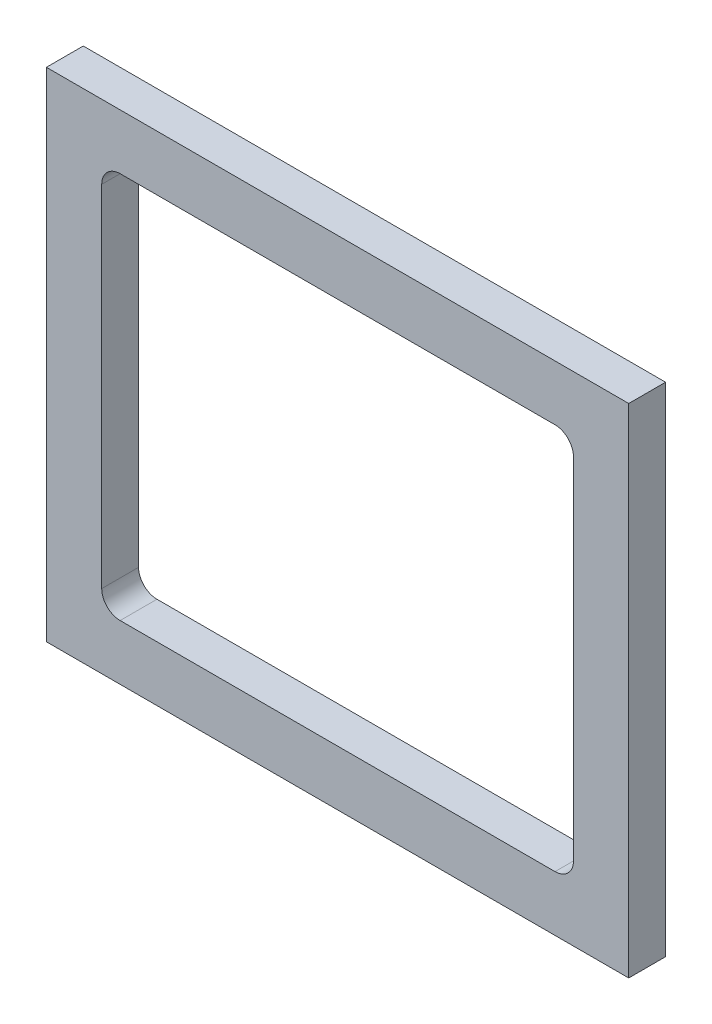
from build123d import *

# Parameters (mm, degrees)
ESQUISSE1_W        = 158
ESQUISSE1_H        = 135
BOSS_EXTRU_2_DEPTH = 10


with BuildPart() as part:
    # Esquisse1 → Boss.-Extru.2 (new body)
    with BuildSketch(Plane.XY):
        with Locations((15.293947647, -18.037652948)):
            Rectangle(ESQUISSE1_W, ESQUISSE1_H)
        with BuildLine():
            Line((-43.706052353, 34.462347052), (74.293947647, 34.462347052))
            ThreePointArc((74.293947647, 34.462347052), (77.829481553, 32.997880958), (79.293947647, 29.462347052))
            Line((79.293947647, 29.462347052), (79.293947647, -65.537652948))
            ThreePointArc((79.293947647, -65.537652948), (77.829481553, -69.073186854), (74.293947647, -70.537652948))
            Line((74.293947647, -70.537652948), (-43.706052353, -70.537652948))
            ThreePointArc((-43.706052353, -70.537652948), (-47.241586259, -69.073186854), (-48.706052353, -65.537652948))
            Line((-48.706052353, -65.537652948), (-48.706052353, 29.462347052))
            ThreePointArc((-48.706052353, 29.462347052), (-47.241586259, 32.997880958), (-43.706052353, 34.462347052))
        make_face(mode=Mode.SUBTRACT)
    extrude(amount=BOSS_EXTRU_2_DEPTH)


solid = part.part
